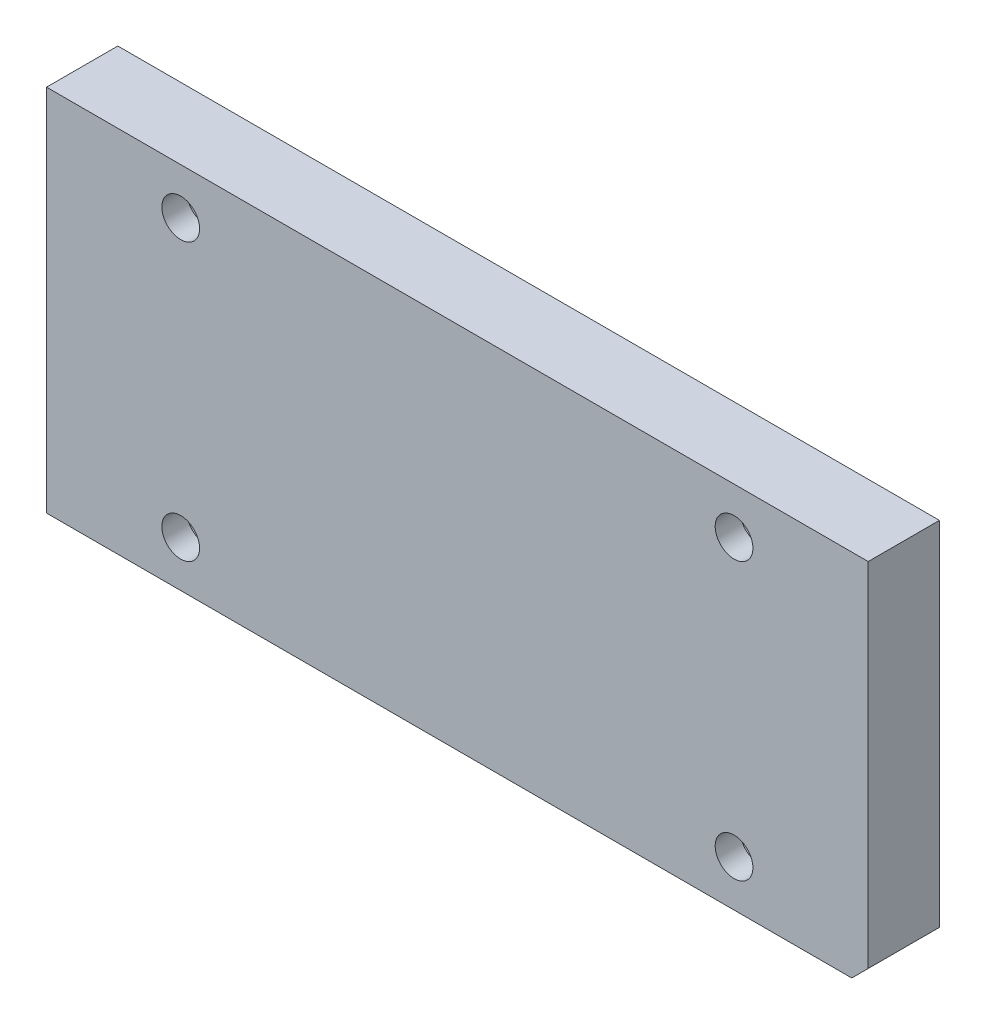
ISO-10303-21;
HEADER;
FILE_DESCRIPTION(('STEP AP214'),'2;1');
FILE_NAME('part.step','',(''),(''),'','','');
FILE_SCHEMA(('AUTOMOTIVE_DESIGN { 1 0 10303 214 1 1 1 1 }'));
ENDSEC;
DATA;
#1=APPLICATION_CONTEXT('core data for automotive mechanical design processes');
#2=APPLICATION_PROTOCOL_DEFINITION('international standard','automotive_design',2000,#1);
#3=PRODUCT_CONTEXT('',#1,'mechanical');
#4=PRODUCT('Part','Part','',(#3));
#5=PRODUCT_RELATED_PRODUCT_CATEGORY('part','',(#4));
#6=PRODUCT_DEFINITION_FORMATION('','',#4);
#7=PRODUCT_DEFINITION_CONTEXT('part definition',#1,'design');
#8=PRODUCT_DEFINITION('design','',#6,#7);
#9=PRODUCT_DEFINITION_SHAPE('','',#8);
#10=(LENGTH_UNIT() NAMED_UNIT(*) SI_UNIT(.MILLI.,.METRE.));
#11=(NAMED_UNIT(*) PLANE_ANGLE_UNIT() SI_UNIT($,.RADIAN.));
#12=(NAMED_UNIT(*) SI_UNIT($,.STERADIAN.) SOLID_ANGLE_UNIT());
#13=UNCERTAINTY_MEASURE_WITH_UNIT(LENGTH_MEASURE(1.E-05),#10,'distance_accuracy_value','');
#14=(GEOMETRIC_REPRESENTATION_CONTEXT(3) GLOBAL_UNCERTAINTY_ASSIGNED_CONTEXT((#13)) GLOBAL_UNIT_ASSIGNED_CONTEXT((#10,
#11,#12)) REPRESENTATION_CONTEXT('',''));
#15=CARTESIAN_POINT('',(0.,0.,0.));
#16=DIRECTION('',(0.,0.,1.));
#17=DIRECTION('',(1.,0.,0.));
#18=AXIS2_PLACEMENT_3D('',#15,#16,#17);
#19=CARTESIAN_POINT('',(-98.,-44.,-231.848784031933));
#20=DIRECTION('',(-1.,0.,0.));
#21=DIRECTION('',(0.,0.,1.));
#22=AXIS2_PLACEMENT_3D('',#19,#20,#21);
#23=PLANE('',#22);
#24=DIRECTION('',(0.,1.,0.));
#25=VECTOR('',#24,1.);
#26=CARTESIAN_POINT('',(-98.,-44.,-17.));
#27=LINE('',#26,#25);
#28=CARTESIAN_POINT('',(-98.,-44.,-17.));
#29=VERTEX_POINT('',#28);
#30=CARTESIAN_POINT('',(-98.,44.,-17.));
#31=VERTEX_POINT('',#30);
#32=EDGE_CURVE('E197',#29,#31,#27,.T.);
#33=ORIENTED_EDGE('',*,*,#32,.F.);
#34=DIRECTION('',(0.,0.,1.));
#35=VECTOR('',#34,1.);
#36=CARTESIAN_POINT('',(-98.,-44.,-231.848784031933));
#37=LINE('',#36,#35);
#38=CARTESIAN_POINT('',(-98.,-44.,0.));
#39=VERTEX_POINT('',#38);
#40=EDGE_CURVE('E209',#29,#39,#37,.T.);
#41=ORIENTED_EDGE('',*,*,#40,.T.);
#42=DIRECTION('',(0.,-1.,0.));
#43=VECTOR('',#42,1.);
#44=CARTESIAN_POINT('',(-98.,-44.,0.));
#45=LINE('',#44,#43);
#46=CARTESIAN_POINT('',(-98.,44.,0.));
#47=VERTEX_POINT('',#46);
#48=EDGE_CURVE('E191',#47,#39,#45,.T.);
#49=ORIENTED_EDGE('',*,*,#48,.F.);
#50=DIRECTION('',(0.,0.,1.));
#51=VECTOR('',#50,1.);
#52=CARTESIAN_POINT('',(-98.,44.,-231.848784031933));
#53=LINE('',#52,#51);
#54=EDGE_CURVE('E195',#31,#47,#53,.T.);
#55=ORIENTED_EDGE('',*,*,#54,.F.);
#56=EDGE_LOOP('',(#33,#41,#49,#55));
#57=FACE_BOUND('',#56,.T.);
#58=ADVANCED_FACE('F34',(#57),#23,.T.);
#59=CARTESIAN_POINT('',(-98.,44.,-231.848784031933));
#60=DIRECTION('',(0.,1.,0.));
#61=DIRECTION('',(-1.,0.,0.));
#62=AXIS2_PLACEMENT_3D('',#59,#60,#61);
#63=PLANE('',#62);
#64=DIRECTION('',(1.,0.,0.));
#65=VECTOR('',#64,1.);
#66=CARTESIAN_POINT('',(-98.,44.,-17.));
#67=LINE('',#66,#65);
#68=CARTESIAN_POINT('',(98.,44.,-17.));
#69=VERTEX_POINT('',#68);
#70=EDGE_CURVE('E194',#31,#69,#67,.T.);
#71=ORIENTED_EDGE('',*,*,#70,.F.);
#72=ORIENTED_EDGE('',*,*,#54,.T.);
#73=DIRECTION('',(-1.,0.,0.));
#74=VECTOR('',#73,1.);
#75=CARTESIAN_POINT('',(-98.,44.,0.));
#76=LINE('',#75,#74);
#77=CARTESIAN_POINT('',(98.,44.,0.));
#78=VERTEX_POINT('',#77);
#79=EDGE_CURVE('E206',#78,#47,#76,.T.);
#80=ORIENTED_EDGE('',*,*,#79,.F.);
#81=DIRECTION('',(0.,0.,1.));
#82=VECTOR('',#81,1.);
#83=CARTESIAN_POINT('',(98.,44.,-231.848784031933));
#84=LINE('',#83,#82);
#85=EDGE_CURVE('E211',#69,#78,#84,.T.);
#86=ORIENTED_EDGE('',*,*,#85,.F.);
#87=EDGE_LOOP('',(#71,#72,#80,#86));
#88=FACE_BOUND('',#87,.T.);
#89=ADVANCED_FACE('F238',(#88),#63,.T.);
#90=CARTESIAN_POINT('',(98.,-44.,-231.848784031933));
#91=DIRECTION('',(1.,0.,0.));
#92=DIRECTION('',(0.,0.,-1.));
#93=AXIS2_PLACEMENT_3D('',#90,#91,#92);
#94=PLANE('',#93);
#95=DIRECTION('',(0.,1.,0.));
#96=VECTOR('',#95,1.);
#97=CARTESIAN_POINT('',(98.,-44.,0.));
#98=LINE('',#97,#96);
#99=CARTESIAN_POINT('',(98.,-40.08,0.));
#100=VERTEX_POINT('',#99);
#101=EDGE_CURVE('E204',#100,#78,#98,.T.);
#102=ORIENTED_EDGE('',*,*,#101,.F.);
#103=DIRECTION('',(0.,0.,-1.));
#104=VECTOR('',#103,1.);
#105=CARTESIAN_POINT('',(98.,-40.08,-231.848784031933));
#106=LINE('',#105,#104);
#107=CARTESIAN_POINT('',(98.,-40.08,-17.));
#108=VERTEX_POINT('',#107);
#109=EDGE_CURVE('E42',#100,#108,#106,.T.);
#110=ORIENTED_EDGE('',*,*,#109,.T.);
#111=DIRECTION('',(0.,-1.,0.));
#112=VECTOR('',#111,1.);
#113=CARTESIAN_POINT('',(98.,-44.,-17.));
#114=LINE('',#113,#112);
#115=EDGE_CURVE('E192',#69,#108,#114,.T.);
#116=ORIENTED_EDGE('',*,*,#115,.F.);
#117=ORIENTED_EDGE('',*,*,#85,.T.);
#118=EDGE_LOOP('',(#102,#110,#116,#117));
#119=FACE_BOUND('',#118,.T.);
#120=ADVANCED_FACE('F239',(#119),#94,.T.);
#121=CARTESIAN_POINT('',(-98.,-44.,-231.848784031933));
#122=DIRECTION('',(0.,-1.,0.));
#123=DIRECTION('',(0.,0.,-1.));
#124=AXIS2_PLACEMENT_3D('',#121,#122,#123);
#125=PLANE('',#124);
#126=DIRECTION('',(-1.,0.,0.));
#127=VECTOR('',#126,1.);
#128=CARTESIAN_POINT('',(-98.,-44.,-17.));
#129=LINE('',#128,#127);
#130=CARTESIAN_POINT('',(94.08,-44.,-17.));
#131=VERTEX_POINT('',#130);
#132=EDGE_CURVE('E199',#131,#29,#129,.T.);
#133=ORIENTED_EDGE('',*,*,#132,.F.);
#134=DIRECTION('',(0.,0.,1.));
#135=VECTOR('',#134,1.);
#136=CARTESIAN_POINT('',(94.08,-44.,-231.848784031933));
#137=LINE('',#136,#135);
#138=CARTESIAN_POINT('',(94.08,-44.,0.));
#139=VERTEX_POINT('',#138);
#140=EDGE_CURVE('E216',#131,#139,#137,.T.);
#141=ORIENTED_EDGE('',*,*,#140,.T.);
#142=DIRECTION('',(1.,0.,0.));
#143=VECTOR('',#142,1.);
#144=CARTESIAN_POINT('',(-98.,-44.,0.));
#145=LINE('',#144,#143);
#146=EDGE_CURVE('E202',#39,#139,#145,.T.);
#147=ORIENTED_EDGE('',*,*,#146,.F.);
#148=ORIENTED_EDGE('',*,*,#40,.F.);
#149=EDGE_LOOP('',(#133,#141,#147,#148));
#150=FACE_BOUND('',#149,.T.);
#151=ADVANCED_FACE('F223',(#150),#125,.T.);
#152=CARTESIAN_POINT('',(0.,0.,0.));
#153=DIRECTION('',(0.,0.,-1.));
#154=DIRECTION('',(-1.,0.,0.));
#155=AXIS2_PLACEMENT_3D('',#152,#153,#154);
#156=PLANE('',#155);
#157=CARTESIAN_POINT('',(66.,-33.,0.));
#158=DIRECTION('',(0.,0.,-1.));
#159=DIRECTION('',(-1.,0.,0.));
#160=AXIS2_PLACEMENT_3D('',#157,#158,#159);
#161=CIRCLE('',#160,4.5);
#162=CARTESIAN_POINT('',(61.5,-33.,0.));
#163=VERTEX_POINT('',#162);
#164=EDGE_CURVE('E152',#163,#163,#161,.T.);
#165=ORIENTED_EDGE('',*,*,#164,.T.);
#166=EDGE_LOOP('',(#165));
#167=FACE_BOUND('',#166,.T.);
#168=CARTESIAN_POINT('',(-66.,-33.,0.));
#169=DIRECTION('',(0.,0.,-1.));
#170=DIRECTION('',(-1.,0.,0.));
#171=AXIS2_PLACEMENT_3D('',#168,#169,#170);
#172=CIRCLE('',#171,4.5);
#173=CARTESIAN_POINT('',(-70.5,-33.,0.));
#174=VERTEX_POINT('',#173);
#175=EDGE_CURVE('E164',#174,#174,#172,.T.);
#176=ORIENTED_EDGE('',*,*,#175,.T.);
#177=EDGE_LOOP('',(#176));
#178=FACE_BOUND('',#177,.T.);
#179=CARTESIAN_POINT('',(-66.,33.,0.));
#180=DIRECTION('',(0.,0.,-1.));
#181=DIRECTION('',(-1.,0.,0.));
#182=AXIS2_PLACEMENT_3D('',#179,#180,#181);
#183=CIRCLE('',#182,4.5);
#184=CARTESIAN_POINT('',(-70.5,33.,0.));
#185=VERTEX_POINT('',#184);
#186=EDGE_CURVE('E176',#185,#185,#183,.T.);
#187=ORIENTED_EDGE('',*,*,#186,.T.);
#188=EDGE_LOOP('',(#187));
#189=FACE_BOUND('',#188,.T.);
#190=CARTESIAN_POINT('',(66.,33.,0.));
#191=DIRECTION('',(0.,0.,-1.));
#192=DIRECTION('',(-1.,0.,0.));
#193=AXIS2_PLACEMENT_3D('',#190,#191,#192);
#194=CIRCLE('',#193,4.5);
#195=CARTESIAN_POINT('',(61.5,33.,0.));
#196=VERTEX_POINT('',#195);
#197=EDGE_CURVE('E188',#196,#196,#194,.T.);
#198=ORIENTED_EDGE('',*,*,#197,.T.);
#199=EDGE_LOOP('',(#198));
#200=FACE_BOUND('',#199,.T.);
#201=ORIENTED_EDGE('',*,*,#146,.T.);
#202=DIRECTION('',(-0.707106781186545,-0.70710678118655,0.));
#203=VECTOR('',#202,1.);
#204=CARTESIAN_POINT('',(94.08,-44.,0.));
#205=LINE('',#204,#203);
#206=EDGE_CURVE('E56',#139,#100,#205,.F.);
#207=ORIENTED_EDGE('',*,*,#206,.T.);
#208=ORIENTED_EDGE('',*,*,#101,.T.);
#209=ORIENTED_EDGE('',*,*,#79,.T.);
#210=ORIENTED_EDGE('',*,*,#48,.T.);
#211=EDGE_LOOP('',(#201,#207,#208,#209,#210));
#212=FACE_BOUND('',#211,.T.);
#213=ADVANCED_FACE('F227',(#167,#178,#189,#200,#212),#156,.F.);
#214=CARTESIAN_POINT('',(0.,0.,-17.));
#215=DIRECTION('',(0.,0.,1.));
#216=DIRECTION('',(1.,0.,0.));
#217=AXIS2_PLACEMENT_3D('',#214,#215,#216);
#218=PLANE('',#217);
#219=CARTESIAN_POINT('',(83.0000000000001,-33.,-17.0000000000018));
#220=DIRECTION('',(0.,0.,-1.));
#221=DIRECTION('',(-1.,0.,0.));
#222=AXIS2_PLACEMENT_3D('',#219,#220,#221);
#223=CIRCLE('',#222,2.);
#224=CARTESIAN_POINT('',(81.0000000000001,-33.,-17.0000000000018));
#225=VERTEX_POINT('',#224);
#226=EDGE_CURVE('E369',#225,#225,#223,.T.);
#227=ORIENTED_EDGE('',*,*,#226,.F.);
#228=EDGE_LOOP('',(#227));
#229=FACE_BOUND('',#228,.T.);
#230=CARTESIAN_POINT('',(-83.,-33.,-17.0000000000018));
#231=DIRECTION('',(0.,0.,-1.));
#232=DIRECTION('',(-1.,0.,0.));
#233=AXIS2_PLACEMENT_3D('',#230,#231,#232);
#234=CIRCLE('',#233,2.);
#235=CARTESIAN_POINT('',(-85.,-33.,-17.0000000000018));
#236=VERTEX_POINT('',#235);
#237=EDGE_CURVE('E100',#236,#236,#234,.T.);
#238=ORIENTED_EDGE('',*,*,#237,.F.);
#239=EDGE_LOOP('',(#238));
#240=FACE_BOUND('',#239,.T.);
#241=CARTESIAN_POINT('',(-83.,33.,-17.0000000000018));
#242=DIRECTION('',(0.,0.,-1.));
#243=DIRECTION('',(-1.,0.,0.));
#244=AXIS2_PLACEMENT_3D('',#241,#242,#243);
#245=CIRCLE('',#244,2.);
#246=CARTESIAN_POINT('',(-85.,33.,-17.0000000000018));
#247=VERTEX_POINT('',#246);
#248=EDGE_CURVE('E119',#247,#247,#245,.T.);
#249=ORIENTED_EDGE('',*,*,#248,.F.);
#250=EDGE_LOOP('',(#249));
#251=FACE_BOUND('',#250,.T.);
#252=CARTESIAN_POINT('',(83.0000000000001,33.,-17.0000000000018));
#253=DIRECTION('',(0.,0.,-1.));
#254=DIRECTION('',(-1.,0.,0.));
#255=AXIS2_PLACEMENT_3D('',#252,#253,#254);
#256=CIRCLE('',#255,2.);
#257=CARTESIAN_POINT('',(81.0000000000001,33.,-17.0000000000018));
#258=VERTEX_POINT('',#257);
#259=EDGE_CURVE('E131',#258,#258,#256,.T.);
#260=ORIENTED_EDGE('',*,*,#259,.F.);
#261=EDGE_LOOP('',(#260));
#262=FACE_BOUND('',#261,.T.);
#263=CARTESIAN_POINT('',(66.,-33.,-17.));
#264=DIRECTION('',(0.,0.,-1.));
#265=DIRECTION('',(-1.,0.,0.));
#266=AXIS2_PLACEMENT_3D('',#263,#264,#265);
#267=CIRCLE('',#266,7.50000000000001);
#268=CARTESIAN_POINT('',(58.5,-33.,-17.));
#269=VERTEX_POINT('',#268);
#270=EDGE_CURVE('E143',#269,#269,#267,.T.);
#271=ORIENTED_EDGE('',*,*,#270,.F.);
#272=EDGE_LOOP('',(#271));
#273=FACE_BOUND('',#272,.T.);
#274=CARTESIAN_POINT('',(-66.,-33.,-17.));
#275=DIRECTION('',(0.,0.,-1.));
#276=DIRECTION('',(-1.,0.,0.));
#277=AXIS2_PLACEMENT_3D('',#274,#275,#276);
#278=CIRCLE('',#277,7.50000000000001);
#279=CARTESIAN_POINT('',(-73.5000000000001,-33.,-17.));
#280=VERTEX_POINT('',#279);
#281=EDGE_CURVE('E155',#280,#280,#278,.T.);
#282=ORIENTED_EDGE('',*,*,#281,.F.);
#283=EDGE_LOOP('',(#282));
#284=FACE_BOUND('',#283,.T.);
#285=CARTESIAN_POINT('',(-66.,33.,-17.));
#286=DIRECTION('',(0.,0.,-1.));
#287=DIRECTION('',(-1.,0.,0.));
#288=AXIS2_PLACEMENT_3D('',#285,#286,#287);
#289=CIRCLE('',#288,7.50000000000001);
#290=CARTESIAN_POINT('',(-73.5000000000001,33.,-17.));
#291=VERTEX_POINT('',#290);
#292=EDGE_CURVE('E167',#291,#291,#289,.T.);
#293=ORIENTED_EDGE('',*,*,#292,.F.);
#294=EDGE_LOOP('',(#293));
#295=FACE_BOUND('',#294,.T.);
#296=CARTESIAN_POINT('',(66.,33.,-17.));
#297=DIRECTION('',(0.,0.,-1.));
#298=DIRECTION('',(-1.,0.,0.));
#299=AXIS2_PLACEMENT_3D('',#296,#297,#298);
#300=CIRCLE('',#299,7.50000000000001);
#301=CARTESIAN_POINT('',(58.5,33.,-17.));
#302=VERTEX_POINT('',#301);
#303=EDGE_CURVE('E179',#302,#302,#300,.T.);
#304=ORIENTED_EDGE('',*,*,#303,.F.);
#305=EDGE_LOOP('',(#304));
#306=FACE_BOUND('',#305,.T.);
#307=ORIENTED_EDGE('',*,*,#115,.T.);
#308=DIRECTION('',(0.707106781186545,0.70710678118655,0.));
#309=VECTOR('',#308,1.);
#310=CARTESIAN_POINT('',(94.08,-44.,-17.));
#311=LINE('',#310,#309);
#312=EDGE_CURVE('E11',#108,#131,#311,.F.);
#313=ORIENTED_EDGE('',*,*,#312,.T.);
#314=ORIENTED_EDGE('',*,*,#132,.T.);
#315=ORIENTED_EDGE('',*,*,#32,.T.);
#316=ORIENTED_EDGE('',*,*,#70,.T.);
#317=EDGE_LOOP('',(#307,#313,#314,#315,#316));
#318=FACE_BOUND('',#317,.T.);
#319=ADVANCED_FACE('F235',(#229,#240,#251,#262,#273,#284,#295,#306,#318),#218,.F.);
#320=CARTESIAN_POINT('',(66.,33.,-17.));
#321=DIRECTION('',(0.,0.,-1.));
#322=DIRECTION('',(-1.,0.,0.));
#323=AXIS2_PLACEMENT_3D('',#320,#321,#322);
#324=CYLINDRICAL_SURFACE('',#323,4.5);
#325=ORIENTED_EDGE('',*,*,#197,.F.);
#326=EDGE_LOOP('',(#325));
#327=FACE_BOUND('',#326,.T.);
#328=CARTESIAN_POINT('',(66.,33.,-6.));
#329=DIRECTION('',(0.,0.,-1.));
#330=DIRECTION('',(-1.,0.,0.));
#331=AXIS2_PLACEMENT_3D('',#328,#329,#330);
#332=CIRCLE('',#331,4.5);
#333=CARTESIAN_POINT('',(61.5,33.,-6.));
#334=VERTEX_POINT('',#333);
#335=EDGE_CURVE('E185',#334,#334,#332,.T.);
#336=ORIENTED_EDGE('',*,*,#335,.T.);
#337=EDGE_LOOP('',(#336));
#338=FACE_BOUND('',#337,.T.);
#339=ADVANCED_FACE('F263',(#327,#338),#324,.F.);
#340=CARTESIAN_POINT('',(70.5,33.,-6.));
#341=DIRECTION('',(0.,0.,1.));
#342=DIRECTION('',(1.,0.,0.));
#343=AXIS2_PLACEMENT_3D('',#340,#341,#342);
#344=PLANE('',#343);
#345=ORIENTED_EDGE('',*,*,#335,.F.);
#346=EDGE_LOOP('',(#345));
#347=FACE_BOUND('',#346,.T.);
#348=CARTESIAN_POINT('',(66.,33.,-6.));
#349=DIRECTION('',(0.,0.,-1.));
#350=DIRECTION('',(-1.,0.,0.));
#351=AXIS2_PLACEMENT_3D('',#348,#349,#350);
#352=CIRCLE('',#351,7.50000000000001);
#353=CARTESIAN_POINT('',(58.5,33.,-6.));
#354=VERTEX_POINT('',#353);
#355=EDGE_CURVE('E182',#354,#354,#352,.T.);
#356=ORIENTED_EDGE('',*,*,#355,.T.);
#357=EDGE_LOOP('',(#356));
#358=FACE_BOUND('',#357,.T.);
#359=ADVANCED_FACE('F267',(#347,#358),#344,.F.);
#360=CARTESIAN_POINT('',(66.,33.,-17.));
#361=DIRECTION('',(0.,0.,-1.));
#362=DIRECTION('',(-1.,0.,0.));
#363=AXIS2_PLACEMENT_3D('',#360,#361,#362);
#364=CYLINDRICAL_SURFACE('',#363,7.50000000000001);
#365=ORIENTED_EDGE('',*,*,#355,.F.);
#366=EDGE_LOOP('',(#365));
#367=FACE_BOUND('',#366,.T.);
#368=ORIENTED_EDGE('',*,*,#303,.T.);
#369=EDGE_LOOP('',(#368));
#370=FACE_BOUND('',#369,.T.);
#371=ADVANCED_FACE('F271',(#367,#370),#364,.F.);
#372=CARTESIAN_POINT('',(-66.,33.,-17.));
#373=DIRECTION('',(0.,0.,-1.));
#374=DIRECTION('',(-1.,0.,0.));
#375=AXIS2_PLACEMENT_3D('',#372,#373,#374);
#376=CYLINDRICAL_SURFACE('',#375,4.5);
#377=ORIENTED_EDGE('',*,*,#186,.F.);
#378=EDGE_LOOP('',(#377));
#379=FACE_BOUND('',#378,.T.);
#380=CARTESIAN_POINT('',(-66.,33.,-6.));
#381=DIRECTION('',(0.,0.,-1.));
#382=DIRECTION('',(-1.,0.,0.));
#383=AXIS2_PLACEMENT_3D('',#380,#381,#382);
#384=CIRCLE('',#383,4.5);
#385=CARTESIAN_POINT('',(-70.5,33.,-6.));
#386=VERTEX_POINT('',#385);
#387=EDGE_CURVE('E173',#386,#386,#384,.T.);
#388=ORIENTED_EDGE('',*,*,#387,.T.);
#389=EDGE_LOOP('',(#388));
#390=FACE_BOUND('',#389,.T.);
#391=ADVANCED_FACE('F275',(#379,#390),#376,.F.);
#392=CARTESIAN_POINT('',(-61.5,33.,-6.));
#393=DIRECTION('',(0.,0.,1.));
#394=DIRECTION('',(1.,0.,0.));
#395=AXIS2_PLACEMENT_3D('',#392,#393,#394);
#396=PLANE('',#395);
#397=ORIENTED_EDGE('',*,*,#387,.F.);
#398=EDGE_LOOP('',(#397));
#399=FACE_BOUND('',#398,.T.);
#400=CARTESIAN_POINT('',(-66.,33.,-6.));
#401=DIRECTION('',(0.,0.,-1.));
#402=DIRECTION('',(-1.,0.,0.));
#403=AXIS2_PLACEMENT_3D('',#400,#401,#402);
#404=CIRCLE('',#403,7.5);
#405=CARTESIAN_POINT('',(-73.5,33.,-6.));
#406=VERTEX_POINT('',#405);
#407=EDGE_CURVE('E170',#406,#406,#404,.T.);
#408=ORIENTED_EDGE('',*,*,#407,.T.);
#409=EDGE_LOOP('',(#408));
#410=FACE_BOUND('',#409,.T.);
#411=ADVANCED_FACE('F279',(#399,#410),#396,.F.);
#412=CARTESIAN_POINT('',(-66.,33.,-17.));
#413=DIRECTION('',(0.,0.,-1.));
#414=DIRECTION('',(-1.,0.,0.));
#415=AXIS2_PLACEMENT_3D('',#412,#413,#414);
#416=CYLINDRICAL_SURFACE('',#415,7.5);
#417=ORIENTED_EDGE('',*,*,#407,.F.);
#418=EDGE_LOOP('',(#417));
#419=FACE_BOUND('',#418,.T.);
#420=ORIENTED_EDGE('',*,*,#292,.T.);
#421=EDGE_LOOP('',(#420));
#422=FACE_BOUND('',#421,.T.);
#423=ADVANCED_FACE('F283',(#419,#422),#416,.F.);
#424=CARTESIAN_POINT('',(-66.,-33.,-17.));
#425=DIRECTION('',(0.,0.,-1.));
#426=DIRECTION('',(-1.,0.,0.));
#427=AXIS2_PLACEMENT_3D('',#424,#425,#426);
#428=CYLINDRICAL_SURFACE('',#427,4.5);
#429=ORIENTED_EDGE('',*,*,#175,.F.);
#430=EDGE_LOOP('',(#429));
#431=FACE_BOUND('',#430,.T.);
#432=CARTESIAN_POINT('',(-66.,-33.,-6.));
#433=DIRECTION('',(0.,0.,-1.));
#434=DIRECTION('',(-1.,0.,0.));
#435=AXIS2_PLACEMENT_3D('',#432,#433,#434);
#436=CIRCLE('',#435,4.5);
#437=CARTESIAN_POINT('',(-70.5,-33.,-6.));
#438=VERTEX_POINT('',#437);
#439=EDGE_CURVE('E161',#438,#438,#436,.T.);
#440=ORIENTED_EDGE('',*,*,#439,.T.);
#441=EDGE_LOOP('',(#440));
#442=FACE_BOUND('',#441,.T.);
#443=ADVANCED_FACE('F287',(#431,#442),#428,.F.);
#444=CARTESIAN_POINT('',(-61.5,-33.,-6.));
#445=DIRECTION('',(0.,0.,1.));
#446=DIRECTION('',(1.,0.,0.));
#447=AXIS2_PLACEMENT_3D('',#444,#445,#446);
#448=PLANE('',#447);
#449=ORIENTED_EDGE('',*,*,#439,.F.);
#450=EDGE_LOOP('',(#449));
#451=FACE_BOUND('',#450,.T.);
#452=CARTESIAN_POINT('',(-66.,-33.,-6.));
#453=DIRECTION('',(0.,0.,-1.));
#454=DIRECTION('',(-1.,0.,0.));
#455=AXIS2_PLACEMENT_3D('',#452,#453,#454);
#456=CIRCLE('',#455,7.5);
#457=CARTESIAN_POINT('',(-73.5,-33.,-6.));
#458=VERTEX_POINT('',#457);
#459=EDGE_CURVE('E158',#458,#458,#456,.T.);
#460=ORIENTED_EDGE('',*,*,#459,.T.);
#461=EDGE_LOOP('',(#460));
#462=FACE_BOUND('',#461,.T.);
#463=ADVANCED_FACE('F291',(#451,#462),#448,.F.);
#464=CARTESIAN_POINT('',(-66.,-33.,-17.));
#465=DIRECTION('',(0.,0.,-1.));
#466=DIRECTION('',(-1.,0.,0.));
#467=AXIS2_PLACEMENT_3D('',#464,#465,#466);
#468=CYLINDRICAL_SURFACE('',#467,7.5);
#469=ORIENTED_EDGE('',*,*,#459,.F.);
#470=EDGE_LOOP('',(#469));
#471=FACE_BOUND('',#470,.T.);
#472=ORIENTED_EDGE('',*,*,#281,.T.);
#473=EDGE_LOOP('',(#472));
#474=FACE_BOUND('',#473,.T.);
#475=ADVANCED_FACE('F295',(#471,#474),#468,.F.);
#476=CARTESIAN_POINT('',(66.,-33.,-17.));
#477=DIRECTION('',(0.,0.,-1.));
#478=DIRECTION('',(-1.,0.,0.));
#479=AXIS2_PLACEMENT_3D('',#476,#477,#478);
#480=CYLINDRICAL_SURFACE('',#479,4.5);
#481=ORIENTED_EDGE('',*,*,#164,.F.);
#482=EDGE_LOOP('',(#481));
#483=FACE_BOUND('',#482,.T.);
#484=CARTESIAN_POINT('',(66.,-33.,-6.));
#485=DIRECTION('',(0.,0.,-1.));
#486=DIRECTION('',(-1.,0.,0.));
#487=AXIS2_PLACEMENT_3D('',#484,#485,#486);
#488=CIRCLE('',#487,4.5);
#489=CARTESIAN_POINT('',(61.5,-33.,-6.));
#490=VERTEX_POINT('',#489);
#491=EDGE_CURVE('E149',#490,#490,#488,.T.);
#492=ORIENTED_EDGE('',*,*,#491,.T.);
#493=EDGE_LOOP('',(#492));
#494=FACE_BOUND('',#493,.T.);
#495=ADVANCED_FACE('F299',(#483,#494),#480,.F.);
#496=CARTESIAN_POINT('',(70.5,-33.,-6.));
#497=DIRECTION('',(0.,0.,1.));
#498=DIRECTION('',(1.,0.,0.));
#499=AXIS2_PLACEMENT_3D('',#496,#497,#498);
#500=PLANE('',#499);
#501=ORIENTED_EDGE('',*,*,#491,.F.);
#502=EDGE_LOOP('',(#501));
#503=FACE_BOUND('',#502,.T.);
#504=CARTESIAN_POINT('',(66.,-33.,-6.));
#505=DIRECTION('',(0.,0.,-1.));
#506=DIRECTION('',(-1.,0.,0.));
#507=AXIS2_PLACEMENT_3D('',#504,#505,#506);
#508=CIRCLE('',#507,7.50000000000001);
#509=CARTESIAN_POINT('',(58.5,-33.,-6.));
#510=VERTEX_POINT('',#509);
#511=EDGE_CURVE('E146',#510,#510,#508,.T.);
#512=ORIENTED_EDGE('',*,*,#511,.T.);
#513=EDGE_LOOP('',(#512));
#514=FACE_BOUND('',#513,.T.);
#515=ADVANCED_FACE('F303',(#503,#514),#500,.F.);
#516=CARTESIAN_POINT('',(66.,-33.,-17.));
#517=DIRECTION('',(0.,0.,-1.));
#518=DIRECTION('',(-1.,0.,0.));
#519=AXIS2_PLACEMENT_3D('',#516,#517,#518);
#520=CYLINDRICAL_SURFACE('',#519,7.50000000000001);
#521=ORIENTED_EDGE('',*,*,#511,.F.);
#522=EDGE_LOOP('',(#521));
#523=FACE_BOUND('',#522,.T.);
#524=ORIENTED_EDGE('',*,*,#270,.T.);
#525=EDGE_LOOP('',(#524));
#526=FACE_BOUND('',#525,.T.);
#527=ADVANCED_FACE('F307',(#523,#526),#520,.F.);
#528=CARTESIAN_POINT('',(83.0000000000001,33.,-5.9914200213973));
#529=DIRECTION('',(0.,0.,-1.));
#530=DIRECTION('',(-1.,0.,0.));
#531=AXIS2_PLACEMENT_3D('',#528,#529,#530);
#532=CONICAL_SURFACE('',#531,1.65,1.02974425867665);
#533=CARTESIAN_POINT('',(83.0000000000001,33.,-5.00000000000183));
#534=VERTEX_POINT('',#533);
#535=VERTEX_LOOP('',#534);
#536=FACE_BOUND('',#535,.T.);
#537=CARTESIAN_POINT('',(83.0000000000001,33.,-5.9914200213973));
#538=DIRECTION('',(0.,0.,-1.));
#539=DIRECTION('',(-1.,0.,0.));
#540=AXIS2_PLACEMENT_3D('',#537,#538,#539);
#541=CIRCLE('',#540,1.65);
#542=CARTESIAN_POINT('',(81.3500000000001,33.,-5.9914200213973));
#543=VERTEX_POINT('',#542);
#544=EDGE_CURVE('E140',#543,#543,#541,.T.);
#545=ORIENTED_EDGE('',*,*,#544,.T.);
#546=EDGE_LOOP('',(#545));
#547=FACE_BOUND('',#546,.T.);
#548=ADVANCED_FACE('F311',(#536,#547),#532,.F.);
#549=CARTESIAN_POINT('',(83.0000000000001,33.,-17.0000000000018));
#550=DIRECTION('',(0.,0.,-1.));
#551=DIRECTION('',(-1.,0.,0.));
#552=AXIS2_PLACEMENT_3D('',#549,#550,#551);
#553=CYLINDRICAL_SURFACE('',#552,1.65);
#554=ORIENTED_EDGE('',*,*,#544,.F.);
#555=EDGE_LOOP('',(#554));
#556=FACE_BOUND('',#555,.T.);
#557=CARTESIAN_POINT('',(83.0000000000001,33.,-10.0000000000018));
#558=DIRECTION('',(0.,0.,-1.));
#559=DIRECTION('',(-1.,0.,0.));
#560=AXIS2_PLACEMENT_3D('',#557,#558,#559);
#561=CIRCLE('',#560,1.65);
#562=CARTESIAN_POINT('',(81.3500000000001,33.,-10.0000000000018));
#563=VERTEX_POINT('',#562);
#564=EDGE_CURVE('E137',#563,#563,#561,.T.);
#565=ORIENTED_EDGE('',*,*,#564,.T.);
#566=EDGE_LOOP('',(#565));
#567=FACE_BOUND('',#566,.T.);
#568=ADVANCED_FACE('F315',(#556,#567),#553,.F.);
#569=CARTESIAN_POINT('',(84.6500000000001,33.,-10.0000000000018));
#570=DIRECTION('',(0.,0.,1.));
#571=DIRECTION('',(1.,0.,0.));
#572=AXIS2_PLACEMENT_3D('',#569,#570,#571);
#573=PLANE('',#572);
#574=ORIENTED_EDGE('',*,*,#564,.F.);
#575=EDGE_LOOP('',(#574));
#576=FACE_BOUND('',#575,.T.);
#577=CARTESIAN_POINT('',(83.0000000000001,33.,-10.0000000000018));
#578=DIRECTION('',(0.,0.,-1.));
#579=DIRECTION('',(-1.,0.,0.));
#580=AXIS2_PLACEMENT_3D('',#577,#578,#579);
#581=CIRCLE('',#580,2.);
#582=CARTESIAN_POINT('',(81.0000000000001,33.,-10.0000000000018));
#583=VERTEX_POINT('',#582);
#584=EDGE_CURVE('E134',#583,#583,#581,.T.);
#585=ORIENTED_EDGE('',*,*,#584,.T.);
#586=EDGE_LOOP('',(#585));
#587=FACE_BOUND('',#586,.T.);
#588=ADVANCED_FACE('F319',(#576,#587),#573,.F.);
#589=CARTESIAN_POINT('',(83.0000000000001,33.,-17.0000000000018));
#590=DIRECTION('',(0.,0.,-1.));
#591=DIRECTION('',(-1.,0.,0.));
#592=AXIS2_PLACEMENT_3D('',#589,#590,#591);
#593=CYLINDRICAL_SURFACE('',#592,2.);
#594=ORIENTED_EDGE('',*,*,#584,.F.);
#595=EDGE_LOOP('',(#594));
#596=FACE_BOUND('',#595,.T.);
#597=ORIENTED_EDGE('',*,*,#259,.T.);
#598=EDGE_LOOP('',(#597));
#599=FACE_BOUND('',#598,.T.);
#600=ADVANCED_FACE('F323',(#596,#599),#593,.F.);
#601=CARTESIAN_POINT('',(-83.,33.,-5.9914200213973));
#602=DIRECTION('',(0.,0.,-1.));
#603=DIRECTION('',(-1.,0.,0.));
#604=AXIS2_PLACEMENT_3D('',#601,#602,#603);
#605=CONICAL_SURFACE('',#604,1.65,1.02974425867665);
#606=CARTESIAN_POINT('',(-83.,33.,-5.00000000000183));
#607=VERTEX_POINT('',#606);
#608=VERTEX_LOOP('',#607);
#609=FACE_BOUND('',#608,.T.);
#610=CARTESIAN_POINT('',(-83.,33.,-5.9914200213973));
#611=DIRECTION('',(0.,0.,-1.));
#612=DIRECTION('',(-1.,0.,0.));
#613=AXIS2_PLACEMENT_3D('',#610,#611,#612);
#614=CIRCLE('',#613,1.65);
#615=CARTESIAN_POINT('',(-84.65,33.,-5.9914200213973));
#616=VERTEX_POINT('',#615);
#617=EDGE_CURVE('E128',#616,#616,#614,.T.);
#618=ORIENTED_EDGE('',*,*,#617,.T.);
#619=EDGE_LOOP('',(#618));
#620=FACE_BOUND('',#619,.T.);
#621=ADVANCED_FACE('F327',(#609,#620),#605,.F.);
#622=CARTESIAN_POINT('',(-83.,33.,-17.0000000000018));
#623=DIRECTION('',(0.,0.,-1.));
#624=DIRECTION('',(-1.,0.,0.));
#625=AXIS2_PLACEMENT_3D('',#622,#623,#624);
#626=CYLINDRICAL_SURFACE('',#625,1.65);
#627=ORIENTED_EDGE('',*,*,#617,.F.);
#628=EDGE_LOOP('',(#627));
#629=FACE_BOUND('',#628,.T.);
#630=CARTESIAN_POINT('',(-83.,33.,-10.0000000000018));
#631=DIRECTION('',(0.,0.,-1.));
#632=DIRECTION('',(-1.,0.,0.));
#633=AXIS2_PLACEMENT_3D('',#630,#631,#632);
#634=CIRCLE('',#633,1.65);
#635=CARTESIAN_POINT('',(-84.65,33.,-10.0000000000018));
#636=VERTEX_POINT('',#635);
#637=EDGE_CURVE('E125',#636,#636,#634,.T.);
#638=ORIENTED_EDGE('',*,*,#637,.T.);
#639=EDGE_LOOP('',(#638));
#640=FACE_BOUND('',#639,.T.);
#641=ADVANCED_FACE('F331',(#629,#640),#626,.F.);
#642=CARTESIAN_POINT('',(-81.35,33.,-10.0000000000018));
#643=DIRECTION('',(0.,0.,1.));
#644=DIRECTION('',(1.,0.,0.));
#645=AXIS2_PLACEMENT_3D('',#642,#643,#644);
#646=PLANE('',#645);
#647=ORIENTED_EDGE('',*,*,#637,.F.);
#648=EDGE_LOOP('',(#647));
#649=FACE_BOUND('',#648,.T.);
#650=CARTESIAN_POINT('',(-83.,33.,-10.0000000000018));
#651=DIRECTION('',(0.,0.,-1.));
#652=DIRECTION('',(-1.,0.,0.));
#653=AXIS2_PLACEMENT_3D('',#650,#651,#652);
#654=CIRCLE('',#653,2.);
#655=CARTESIAN_POINT('',(-85.,33.,-10.0000000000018));
#656=VERTEX_POINT('',#655);
#657=EDGE_CURVE('E122',#656,#656,#654,.T.);
#658=ORIENTED_EDGE('',*,*,#657,.T.);
#659=EDGE_LOOP('',(#658));
#660=FACE_BOUND('',#659,.T.);
#661=ADVANCED_FACE('F335',(#649,#660),#646,.F.);
#662=CARTESIAN_POINT('',(-83.,33.,-17.0000000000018));
#663=DIRECTION('',(0.,0.,-1.));
#664=DIRECTION('',(-1.,0.,0.));
#665=AXIS2_PLACEMENT_3D('',#662,#663,#664);
#666=CYLINDRICAL_SURFACE('',#665,2.);
#667=ORIENTED_EDGE('',*,*,#657,.F.);
#668=EDGE_LOOP('',(#667));
#669=FACE_BOUND('',#668,.T.);
#670=ORIENTED_EDGE('',*,*,#248,.T.);
#671=EDGE_LOOP('',(#670));
#672=FACE_BOUND('',#671,.T.);
#673=ADVANCED_FACE('F339',(#669,#672),#666,.F.);
#674=CARTESIAN_POINT('',(-83.,-33.,-5.9914200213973));
#675=DIRECTION('',(0.,0.,-1.));
#676=DIRECTION('',(-1.,0.,0.));
#677=AXIS2_PLACEMENT_3D('',#674,#675,#676);
#678=CONICAL_SURFACE('',#677,1.65,1.02974425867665);
#679=CARTESIAN_POINT('',(-83.,-33.,-5.00000000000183));
#680=VERTEX_POINT('',#679);
#681=VERTEX_LOOP('',#680);
#682=FACE_BOUND('',#681,.T.);
#683=CARTESIAN_POINT('',(-83.,-33.,-5.9914200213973));
#684=DIRECTION('',(0.,0.,-1.));
#685=DIRECTION('',(-1.,0.,0.));
#686=AXIS2_PLACEMENT_3D('',#683,#684,#685);
#687=CIRCLE('',#686,1.65);
#688=CARTESIAN_POINT('',(-84.65,-33.,-5.9914200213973));
#689=VERTEX_POINT('',#688);
#690=EDGE_CURVE('E116',#689,#689,#687,.T.);
#691=ORIENTED_EDGE('',*,*,#690,.T.);
#692=EDGE_LOOP('',(#691));
#693=FACE_BOUND('',#692,.T.);
#694=ADVANCED_FACE('F343',(#682,#693),#678,.F.);
#695=CARTESIAN_POINT('',(-83.,-33.,-17.0000000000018));
#696=DIRECTION('',(0.,0.,-1.));
#697=DIRECTION('',(-1.,0.,0.));
#698=AXIS2_PLACEMENT_3D('',#695,#696,#697);
#699=CYLINDRICAL_SURFACE('',#698,1.65);
#700=ORIENTED_EDGE('',*,*,#690,.F.);
#701=EDGE_LOOP('',(#700));
#702=FACE_BOUND('',#701,.T.);
#703=CARTESIAN_POINT('',(-83.,-33.,-10.0000000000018));
#704=DIRECTION('',(0.,0.,-1.));
#705=DIRECTION('',(-1.,0.,0.));
#706=AXIS2_PLACEMENT_3D('',#703,#704,#705);
#707=CIRCLE('',#706,1.65);
#708=CARTESIAN_POINT('',(-84.65,-33.,-10.0000000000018));
#709=VERTEX_POINT('',#708);
#710=EDGE_CURVE('E113',#709,#709,#707,.T.);
#711=ORIENTED_EDGE('',*,*,#710,.T.);
#712=EDGE_LOOP('',(#711));
#713=FACE_BOUND('',#712,.T.);
#714=ADVANCED_FACE('F347',(#702,#713),#699,.F.);
#715=CARTESIAN_POINT('',(-81.35,-33.,-10.0000000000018));
#716=DIRECTION('',(0.,0.,1.));
#717=DIRECTION('',(1.,0.,0.));
#718=AXIS2_PLACEMENT_3D('',#715,#716,#717);
#719=PLANE('',#718);
#720=ORIENTED_EDGE('',*,*,#710,.F.);
#721=EDGE_LOOP('',(#720));
#722=FACE_BOUND('',#721,.T.);
#723=CARTESIAN_POINT('',(-83.,-33.,-10.0000000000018));
#724=DIRECTION('',(0.,0.,-1.));
#725=DIRECTION('',(-1.,0.,0.));
#726=AXIS2_PLACEMENT_3D('',#723,#724,#725);
#727=CIRCLE('',#726,2.);
#728=CARTESIAN_POINT('',(-85.,-33.,-10.0000000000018));
#729=VERTEX_POINT('',#728);
#730=EDGE_CURVE('E104',#729,#729,#727,.T.);
#731=ORIENTED_EDGE('',*,*,#730,.T.);
#732=EDGE_LOOP('',(#731));
#733=FACE_BOUND('',#732,.T.);
#734=ADVANCED_FACE('F351',(#722,#733),#719,.F.);
#735=CARTESIAN_POINT('',(-83.,-33.,-17.0000000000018));
#736=DIRECTION('',(0.,0.,-1.));
#737=DIRECTION('',(-1.,0.,0.));
#738=AXIS2_PLACEMENT_3D('',#735,#736,#737);
#739=CYLINDRICAL_SURFACE('',#738,2.);
#740=ORIENTED_EDGE('',*,*,#730,.F.);
#741=EDGE_LOOP('',(#740));
#742=FACE_BOUND('',#741,.T.);
#743=ORIENTED_EDGE('',*,*,#237,.T.);
#744=EDGE_LOOP('',(#743));
#745=FACE_BOUND('',#744,.T.);
#746=ADVANCED_FACE('F94',(#742,#745),#739,.F.);
#747=CARTESIAN_POINT('',(83.0000000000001,-33.,-5.9914200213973));
#748=DIRECTION('',(0.,0.,-1.));
#749=DIRECTION('',(-1.,0.,0.));
#750=AXIS2_PLACEMENT_3D('',#747,#748,#749);
#751=CONICAL_SURFACE('',#750,1.65,1.02974425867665);
#752=CARTESIAN_POINT('',(83.0000000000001,-33.,-5.00000000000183));
#753=VERTEX_POINT('',#752);
#754=VERTEX_LOOP('',#753);
#755=FACE_BOUND('',#754,.T.);
#756=CARTESIAN_POINT('',(83.0000000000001,-33.,-5.9914200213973));
#757=DIRECTION('',(0.,0.,-1.));
#758=DIRECTION('',(-1.,0.,0.));
#759=AXIS2_PLACEMENT_3D('',#756,#757,#758);
#760=CIRCLE('',#759,1.65);
#761=CARTESIAN_POINT('',(81.3500000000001,-33.,-5.9914200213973));
#762=VERTEX_POINT('',#761);
#763=EDGE_CURVE('E98',#762,#762,#760,.T.);
#764=ORIENTED_EDGE('',*,*,#763,.T.);
#765=EDGE_LOOP('',(#764));
#766=FACE_BOUND('',#765,.T.);
#767=ADVANCED_FACE('F90',(#755,#766),#751,.F.);
#768=CARTESIAN_POINT('',(83.0000000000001,-33.,-17.0000000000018));
#769=DIRECTION('',(0.,0.,-1.));
#770=DIRECTION('',(-1.,0.,0.));
#771=AXIS2_PLACEMENT_3D('',#768,#769,#770);
#772=CYLINDRICAL_SURFACE('',#771,1.65);
#773=ORIENTED_EDGE('',*,*,#763,.F.);
#774=EDGE_LOOP('',(#773));
#775=FACE_BOUND('',#774,.T.);
#776=CARTESIAN_POINT('',(83.0000000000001,-33.,-10.0000000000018));
#777=DIRECTION('',(0.,0.,-1.));
#778=DIRECTION('',(-1.,0.,0.));
#779=AXIS2_PLACEMENT_3D('',#776,#777,#778);
#780=CIRCLE('',#779,1.65);
#781=CARTESIAN_POINT('',(81.3500000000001,-33.,-10.0000000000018));
#782=VERTEX_POINT('',#781);
#783=EDGE_CURVE('E101',#782,#782,#780,.T.);
#784=ORIENTED_EDGE('',*,*,#783,.T.);
#785=EDGE_LOOP('',(#784));
#786=FACE_BOUND('',#785,.T.);
#787=ADVANCED_FACE('F93',(#775,#786),#772,.F.);
#788=CARTESIAN_POINT('',(84.6500000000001,-33.,-10.0000000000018));
#789=DIRECTION('',(0.,0.,1.));
#790=DIRECTION('',(1.,0.,0.));
#791=AXIS2_PLACEMENT_3D('',#788,#789,#790);
#792=PLANE('',#791);
#793=ORIENTED_EDGE('',*,*,#783,.F.);
#794=EDGE_LOOP('',(#793));
#795=FACE_BOUND('',#794,.T.);
#796=CARTESIAN_POINT('',(83.0000000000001,-33.,-10.0000000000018));
#797=DIRECTION('',(0.,0.,-1.));
#798=DIRECTION('',(-1.,0.,0.));
#799=AXIS2_PLACEMENT_3D('',#796,#797,#798);
#800=CIRCLE('',#799,2.);
#801=CARTESIAN_POINT('',(81.0000000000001,-33.,-10.0000000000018));
#802=VERTEX_POINT('',#801);
#803=EDGE_CURVE('E107',#802,#802,#800,.T.);
#804=ORIENTED_EDGE('',*,*,#803,.T.);
#805=EDGE_LOOP('',(#804));
#806=FACE_BOUND('',#805,.T.);
#807=ADVANCED_FACE('F245',(#795,#806),#792,.F.);
#808=CARTESIAN_POINT('',(83.0000000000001,-33.,-17.0000000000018));
#809=DIRECTION('',(0.,0.,-1.));
#810=DIRECTION('',(-1.,0.,0.));
#811=AXIS2_PLACEMENT_3D('',#808,#809,#810);
#812=CYLINDRICAL_SURFACE('',#811,2.);
#813=ORIENTED_EDGE('',*,*,#803,.F.);
#814=EDGE_LOOP('',(#813));
#815=FACE_BOUND('',#814,.T.);
#816=ORIENTED_EDGE('',*,*,#226,.T.);
#817=EDGE_LOOP('',(#816));
#818=FACE_BOUND('',#817,.T.);
#819=ADVANCED_FACE('F241',(#815,#818),#812,.F.);
#820=CARTESIAN_POINT('',(94.08,-44.,-231.848784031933));
#821=DIRECTION('',(-0.70710678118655,0.707106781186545,0.));
#822=DIRECTION('',(0.,0.,1.));
#823=AXIS2_PLACEMENT_3D('',#820,#821,#822);
#824=PLANE('',#823);
#825=ORIENTED_EDGE('',*,*,#312,.F.);
#826=ORIENTED_EDGE('',*,*,#109,.F.);
#827=ORIENTED_EDGE('',*,*,#206,.F.);
#828=ORIENTED_EDGE('',*,*,#140,.F.);
#829=EDGE_LOOP('',(#825,#826,#827,#828));
#830=FACE_BOUND('',#829,.T.);
#831=ADVANCED_FACE('F36',(#830),#824,.F.);
#832=CLOSED_SHELL('',(#58,#89,#120,#151,#213,#319,#339,#359,#371,#391,#411,#423,#443,#463,#475,
#495,#515,#527,#548,#568,#588,#600,#621,#641,#661,#673,#694,#714,#734,#746,#767,#787,#807,#819,#831));
#833=MANIFOLD_SOLID_BREP('B2',#832);
#834=ADVANCED_BREP_SHAPE_REPRESENTATION('',(#18,#833),#14);
#835=SHAPE_DEFINITION_REPRESENTATION(#9,#834);
ENDSEC;
END-ISO-10303-21;
